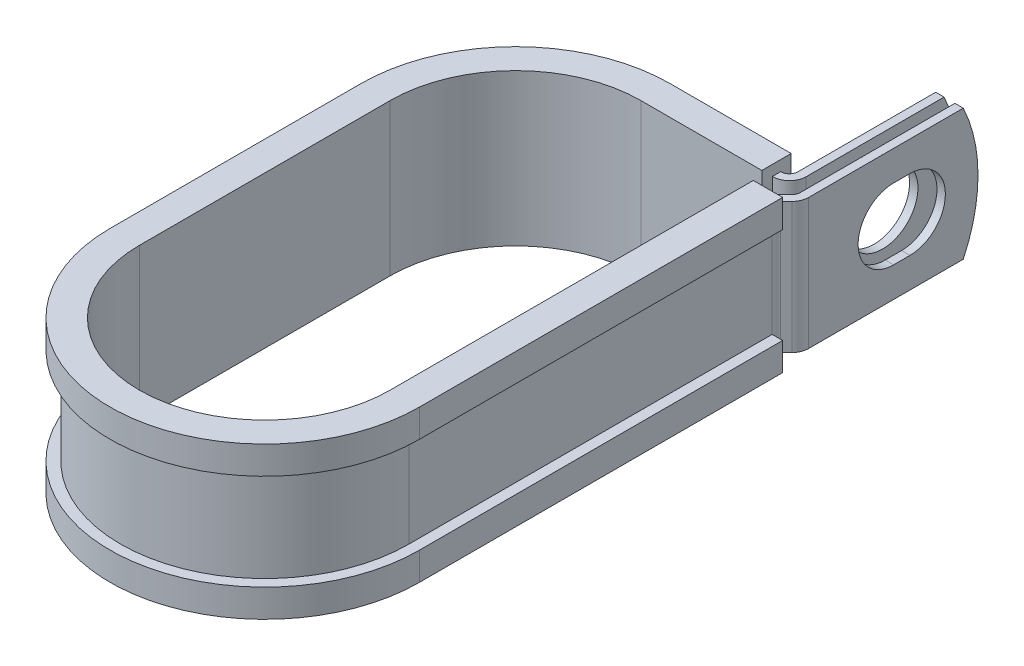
from build123d import *

# Parameters (mm, degrees)
EXTRUDE_THIN1_DEPTH = 9.525
SKETCH2_R           = 5.1562
CUT_EXTRUDE1_DEPTH  = 1.2192
CUT_EXTRUDE2_DEPTH  = 1.2192
CUT_EXTRUDE3_DEPTH  = 71.610293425


with BuildPart() as part:
    # Sketch1 → Extrude-Thin1 (new, symmetric)
    with BuildSketch(Plane(origin=(0, 0, 0), x_dir=(1, 0, 0), z_dir=(0, 1, 0))):
        with BuildLine():
            Line((21.6713698, 44.4246), (21.6713698, 19.7739))
            ThreePointArc((21.6713698, 19.7739), (21.578563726, 19.307332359), (21.314274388, 18.911795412))
            Line((21.314274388, 18.911795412), (20.488090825, 18.085611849))
            ThreePointArc((20.488090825, 18.085611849), (19.959512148, 17.294537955), (19.7739, 16.361402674))
            Line((19.7739, 16.361402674), (19.7739, 0))
            Line((19.7739, 0), (19.7739, -36.4998))
            ThreePointArc((19.7739, -36.4998), (0, -56.2737), (-19.7739, -36.4998))
            Line((-19.7739, -36.4998), (-19.7739, 0))
            ThreePointArc((-19.7739, 0), (-13.982258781, 13.982258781), (0, 19.7739))
            Line((0, 19.7739), (17.6581698, 19.7739))
            ThreePointArc((17.6581698, 19.7739), (19.382378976, 20.488090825), (20.0965698, 22.2123))
            Line((20.0965698, 22.2123), (20.0965698, 44.4246))
            Line((20.0965698, 44.4246), (18.8773698, 44.4246))
            Line((18.8773698, 44.4246), (18.8773698, 22.2123))
            ThreePointArc((18.8773698, 22.2123), (18.520274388, 21.350195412), (17.6581698, 20.9931))
            Line((17.6581698, 20.9931), (0, 20.9931))
            ThreePointArc((0, 20.9931), (-14.844363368, 14.844363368), (-20.9931, 0))
            Line((-20.9931, 0), (-20.9931, -36.4998))
            ThreePointArc((-20.9931, -36.4998), (0, -57.4929), (20.9931, -36.4998))
            Line((20.9931, -36.4998), (20.9931, 0))
            Line((20.9931, 0), (20.9931, 16.361402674))
            ThreePointArc((20.9931, 16.361402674), (21.085906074, 16.827970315), (21.350195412, 17.223507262))
            Line((21.350195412, 17.223507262), (22.176378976, 18.049690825))
            ThreePointArc((22.176378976, 18.049690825), (22.704957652, 18.840764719), (22.8905698, 19.7739))
            Line((22.8905698, 19.7739), (22.8905698, 44.4246))
            Line((22.8905698, 44.4246), (21.6713698, 44.4246))
        make_face()
    extrude(amount=EXTRUDE_THIN1_DEPTH, both=True)

    # Sketch2 → Cut-Extrude1 (cut)
    with BuildSketch(Plane.ZY.offset(-18.8773698)):
        with Locations((-33.3248, 0)):
            Circle(SKETCH2_R)
    extrude(amount=-CUT_EXTRUDE1_DEPTH, mode=Mode.SUBTRACT)

    # Sketch3 → Cut-Extrude2 (cut)
    with BuildSketch(Plane(origin=(22.8905698, 0, 0), x_dir=(0, 0, -1), z_dir=(1, 0, 0))):
        with BuildLine():
            Line((32.131, 5.1562), (34.5186, 5.1562))
            ThreePointArc((34.5186, 5.1562), (39.6748, 0), (34.5186, -5.1562))
            Line((34.5186, -5.1562), (32.131, -5.1562))
            ThreePointArc((32.131, -5.1562), (26.9748, 0), (32.131, 5.1562))
        make_face()
    extrude(amount=-CUT_EXTRUDE2_DEPTH, mode=Mode.SUBTRACT)

    # Sketch4 → Cut-Extrude3 (cut, through all)
    with BuildSketch(Plane.ZY.offset(-18.8773698)):
        with BuildLine():
            Line((-42.280063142, 9.525), (-44.4246, 9.525))
            Line((-44.4246, 9.525), (-44.4246, 0))
            ThreePointArc((-44.4246, 0), (-43.881838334, 4.881717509), (-42.280063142, 9.525))
        make_face()
        with BuildLine():
            ThreePointArc((-42.280063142, -9.525), (-43.881838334, -4.881717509), (-44.4246, 0))
            Line((-44.4246, 0), (-44.4246, -9.525))
            Line((-44.4246, -9.525), (-42.280063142, -9.525))
        make_face()
    extrude(amount=-CUT_EXTRUDE3_DEPTH, mode=Mode.SUBTRACT)

    # Sweep1: sweep along a path in Sketch6
    with BuildLine(Plane(origin=(0, 9.525, 0), x_dir=(1, 0, 0), z_dir=(0, 1, 0))) as sweep1_path:
        Line((18.2499, 16.361402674), (18.2499, 0))
        Line((18.2499, 0), (18.2499, -36.4998))
        ThreePointArc((18.2499, -36.4998), (0, -54.7497), (-18.2499, -36.4998))
        Line((-18.2499, -36.4998), (-18.2499, 0))
        ThreePointArc((-18.2499, 0), (-12.904628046, 12.904628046), (0, 18.2499))
        Line((0, 18.2499), (17.6073698, 18.2499))
    # Sketch5 → Sweep1 (sweep)
    with BuildSketch(Plane(origin=(0, 0, -16.361402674), x_dir=(-1, 0, 0), z_dir=(0, 0, -1))):
        Polygon((-20.9931, 9.525), (-19.7739, 9.525), (-19.7739, -9.525), (-20.9931, -9.525), (-20.9931, -6.985), (-22.5171, -6.985), (-22.5171, -11.049), (-18.2499, -11.049), (-18.2499, 11.049), (-22.5171, 11.049), (-22.5171, 6.985), (-20.9931, 6.985), align=None)
    sweep(path=sweep1_path.line)


solid = part.part
